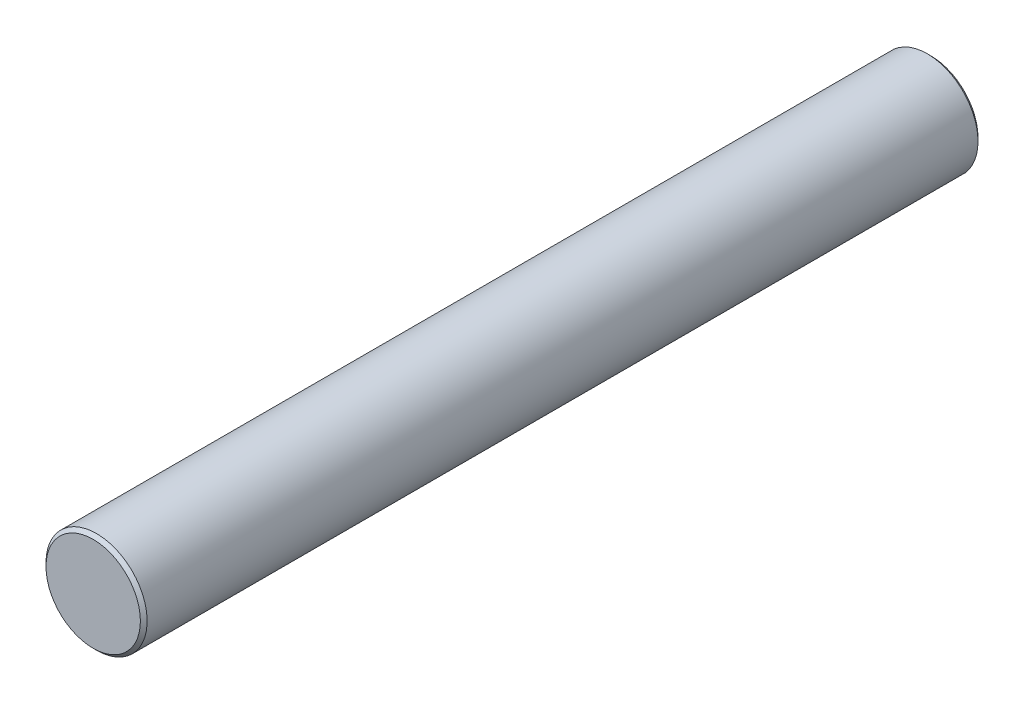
ISO-10303-21;
HEADER;
FILE_DESCRIPTION(('STEP AP214'),'2;1');
FILE_NAME('part.step','',(''),(''),'','','');
FILE_SCHEMA(('AUTOMOTIVE_DESIGN { 1 0 10303 214 1 1 1 1 }'));
ENDSEC;
DATA;
#1=APPLICATION_CONTEXT('core data for automotive mechanical design processes');
#2=APPLICATION_PROTOCOL_DEFINITION('international standard','automotive_design',2000,#1);
#3=PRODUCT_CONTEXT('',#1,'mechanical');
#4=PRODUCT('Part','Part','',(#3));
#5=PRODUCT_RELATED_PRODUCT_CATEGORY('part','',(#4));
#6=PRODUCT_DEFINITION_FORMATION('','',#4);
#7=PRODUCT_DEFINITION_CONTEXT('part definition',#1,'design');
#8=PRODUCT_DEFINITION('design','',#6,#7);
#9=PRODUCT_DEFINITION_SHAPE('','',#8);
#10=(LENGTH_UNIT() NAMED_UNIT(*) SI_UNIT(.MILLI.,.METRE.));
#11=(NAMED_UNIT(*) PLANE_ANGLE_UNIT() SI_UNIT($,.RADIAN.));
#12=(NAMED_UNIT(*) SI_UNIT($,.STERADIAN.) SOLID_ANGLE_UNIT());
#13=UNCERTAINTY_MEASURE_WITH_UNIT(LENGTH_MEASURE(1.E-05),#10,'distance_accuracy_value','');
#14=(GEOMETRIC_REPRESENTATION_CONTEXT(3) GLOBAL_UNCERTAINTY_ASSIGNED_CONTEXT((#13)) GLOBAL_UNIT_ASSIGNED_CONTEXT((#10,
#11,#12)) REPRESENTATION_CONTEXT('',''));
#15=CARTESIAN_POINT('',(0.,0.,0.));
#16=DIRECTION('',(0.,0.,1.));
#17=DIRECTION('',(1.,0.,0.));
#18=AXIS2_PLACEMENT_3D('',#15,#16,#17);
#19=CARTESIAN_POINT('',(0.,0.,497.));
#20=DIRECTION('',(0.,0.,-1.));
#21=DIRECTION('',(-1.,0.,0.));
#22=AXIS2_PLACEMENT_3D('',#19,#20,#21);
#23=CYLINDRICAL_SURFACE('',#22,30.);
#24=CARTESIAN_POINT('',(0.,0.,495.));
#25=DIRECTION('',(0.,0.,1.));
#26=DIRECTION('',(1.,0.,0.));
#27=AXIS2_PLACEMENT_3D('',#24,#25,#26);
#28=CIRCLE('',#27,30.);
#29=CARTESIAN_POINT('',(-30.,0.,495.));
#30=VERTEX_POINT('',#29);
#31=EDGE_CURVE('E46',#30,#30,#28,.F.);
#32=CARTESIAN_POINT('',(0.,0.,2.0000000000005));
#33=DIRECTION('',(0.,0.,1.));
#34=DIRECTION('',(1.,0.,0.));
#35=AXIS2_PLACEMENT_3D('',#32,#33,#34);
#36=CIRCLE('',#35,30.);
#37=CARTESIAN_POINT('',(-30.,0.,2.0000000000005));
#38=VERTEX_POINT('',#37);
#39=EDGE_CURVE('E63',#38,#38,#36,.T.);
#40=CARTESIAN_POINT('',(-30.,0.,495.));
#41=CARTESIAN_POINT('',(-30.,0.,489.864583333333));
#42=CARTESIAN_POINT('',(-30.,0.,484.729166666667));
#43=CARTESIAN_POINT('',(-30.,0.,474.458333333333));
#44=CARTESIAN_POINT('',(-30.,0.,469.322916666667));
#45=CARTESIAN_POINT('',(-30.,0.,459.052083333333));
#46=CARTESIAN_POINT('',(-30.,0.,453.916666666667));
#47=CARTESIAN_POINT('',(-30.,0.,443.645833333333));
#48=CARTESIAN_POINT('',(-30.,0.,438.510416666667));
#49=CARTESIAN_POINT('',(-30.,0.,428.239583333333));
#50=CARTESIAN_POINT('',(-30.,0.,423.104166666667));
#51=CARTESIAN_POINT('',(-30.,0.,412.833333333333));
#52=CARTESIAN_POINT('',(-30.,0.,407.697916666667));
#53=CARTESIAN_POINT('',(-30.,0.,397.427083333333));
#54=CARTESIAN_POINT('',(-30.,0.,392.291666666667));
#55=CARTESIAN_POINT('',(-30.,0.,382.020833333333));
#56=CARTESIAN_POINT('',(-30.,0.,376.885416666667));
#57=CARTESIAN_POINT('',(-30.,0.,366.614583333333));
#58=CARTESIAN_POINT('',(-30.,0.,361.479166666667));
#59=CARTESIAN_POINT('',(-30.,0.,351.208333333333));
#60=CARTESIAN_POINT('',(-30.,0.,346.072916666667));
#61=CARTESIAN_POINT('',(-30.,0.,335.802083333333));
#62=CARTESIAN_POINT('',(-30.,0.,330.666666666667));
#63=CARTESIAN_POINT('',(-30.,0.,320.395833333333));
#64=CARTESIAN_POINT('',(-30.,0.,315.260416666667));
#65=CARTESIAN_POINT('',(-30.,0.,304.989583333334));
#66=CARTESIAN_POINT('',(-30.,0.,299.854166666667));
#67=CARTESIAN_POINT('',(-30.,0.,289.583333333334));
#68=CARTESIAN_POINT('',(-30.,0.,284.447916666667));
#69=CARTESIAN_POINT('',(-30.,0.,274.177083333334));
#70=CARTESIAN_POINT('',(-30.,0.,269.041666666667));
#71=CARTESIAN_POINT('',(-30.,0.,258.770833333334));
#72=CARTESIAN_POINT('',(-30.,0.,253.635416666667));
#73=CARTESIAN_POINT('',(-30.,0.,243.364583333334));
#74=CARTESIAN_POINT('',(-30.,0.,238.229166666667));
#75=CARTESIAN_POINT('',(-30.,0.,227.958333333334));
#76=CARTESIAN_POINT('',(-30.,0.,222.822916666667));
#77=CARTESIAN_POINT('',(-30.,0.,212.552083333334));
#78=CARTESIAN_POINT('',(-30.,0.,207.416666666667));
#79=CARTESIAN_POINT('',(-30.,0.,197.145833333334));
#80=CARTESIAN_POINT('',(-30.,0.,192.010416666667));
#81=CARTESIAN_POINT('',(-30.,0.,181.739583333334));
#82=CARTESIAN_POINT('',(-30.,0.,176.604166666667));
#83=CARTESIAN_POINT('',(-30.,0.,166.333333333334));
#84=CARTESIAN_POINT('',(-30.,0.,161.197916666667));
#85=CARTESIAN_POINT('',(-30.,0.,150.927083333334));
#86=CARTESIAN_POINT('',(-30.,0.,145.791666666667));
#87=CARTESIAN_POINT('',(-30.,0.,135.520833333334));
#88=CARTESIAN_POINT('',(-30.,0.,130.385416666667));
#89=CARTESIAN_POINT('',(-30.,0.,120.114583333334));
#90=CARTESIAN_POINT('',(-30.,0.,114.979166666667));
#91=CARTESIAN_POINT('',(-30.,0.,104.708333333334));
#92=CARTESIAN_POINT('',(-30.,0.,99.5729166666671));
#93=CARTESIAN_POINT('',(-30.,0.,89.3020833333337));
#94=CARTESIAN_POINT('',(-30.,0.,84.1666666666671));
#95=CARTESIAN_POINT('',(-30.,0.,73.8958333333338));
#96=CARTESIAN_POINT('',(-30.,0.,68.7604166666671));
#97=CARTESIAN_POINT('',(-30.,0.,58.4895833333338));
#98=CARTESIAN_POINT('',(-30.,0.,53.3541666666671));
#99=CARTESIAN_POINT('',(-30.,0.,43.0833333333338));
#100=CARTESIAN_POINT('',(-30.,0.,37.9479166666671));
#101=CARTESIAN_POINT('',(-30.,0.,27.6770833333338));
#102=CARTESIAN_POINT('',(-30.,0.,22.5416666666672));
#103=CARTESIAN_POINT('',(-30.,0.,12.2708333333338));
#104=CARTESIAN_POINT('',(-30.,0.,7.13541666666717));
#105=CARTESIAN_POINT('',(-30.,0.,2.0000000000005));
#106=B_SPLINE_CURVE_WITH_KNOTS('',3,(#40,#41,#42,#43,#44,#45,#46,#47,#48,#49,#50,#51,#52,#53,
#54,#55,#56,#57,#58,#59,#60,#61,#62,#63,#64,#65,#66,#67,#68,#69,#70,#71,#72,#73,#74,#75,#76,#77,
#78,#79,#80,#81,#82,#83,#84,#85,#86,#87,#88,#89,#90,#91,#92,#93,#94,#95,#96,#97,#98,#99,#100,
#101,#102,#103,#104,#105),.UNSPECIFIED.,.F.,.F.,(4,2,2,2,2,2,2,2,2,2,2,2,2,2,2,2,2,2,2,2,2,2,2,
2,2,2,2,2,2,2,2,2,4),(0.,15.40625,30.8125,46.2187499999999,61.6249999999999,77.0312499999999,
92.4374999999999,107.84375,123.25,138.65625,154.0625,169.46875,184.875,200.28125,215.6875,
231.09375,246.5,261.90625,277.3125,292.71875,308.125,323.53125,338.9375,354.34375,369.75,
385.15625,400.5625,415.968749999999,431.374999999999,446.781249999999,462.187499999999,
477.593749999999,492.999999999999),.UNSPECIFIED.);
#107=EDGE_CURVE('BSEAM39',#30,#38,#106,.T.);
#108=ORIENTED_EDGE('',*,*,#31,.T.);
#109=ORIENTED_EDGE('',*,*,#39,.T.);
#110=ORIENTED_EDGE('',*,*,#107,.T.);
#111=ORIENTED_EDGE('',*,*,#107,.F.);
#112=EDGE_LOOP('',(#108,#110,#109,#111));
#113=FACE_BOUND('',#112,.T.);
#114=ADVANCED_FACE('F39',(#113),#23,.T.);
#115=CARTESIAN_POINT('',(0.,0.,497.));
#116=DIRECTION('',(0.,0.,1.));
#117=DIRECTION('',(1.,0.,0.));
#118=AXIS2_PLACEMENT_3D('',#115,#116,#117);
#119=PLANE('',#118);
#120=CARTESIAN_POINT('',(0.,0.,497.));
#121=DIRECTION('',(0.,0.,1.));
#122=DIRECTION('',(1.,0.,0.));
#123=AXIS2_PLACEMENT_3D('',#120,#121,#122);
#124=CIRCLE('',#123,28.0000000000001);
#125=CARTESIAN_POINT('',(28.0000000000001,0.,497.));
#126=VERTEX_POINT('',#125);
#127=EDGE_CURVE('E59',#126,#126,#124,.T.);
#128=ORIENTED_EDGE('',*,*,#127,.T.);
#129=EDGE_LOOP('',(#128));
#130=FACE_BOUND('',#129,.T.);
#131=ADVANCED_FACE('F79',(#130),#119,.T.);
#132=CARTESIAN_POINT('',(0.,0.,0.));
#133=DIRECTION('',(0.,0.,1.));
#134=DIRECTION('',(1.,0.,0.));
#135=AXIS2_PLACEMENT_3D('',#132,#133,#134);
#136=PLANE('',#135);
#137=CARTESIAN_POINT('',(0.,0.,0.));
#138=DIRECTION('',(0.,0.,1.));
#139=DIRECTION('',(1.,0.,0.));
#140=AXIS2_PLACEMENT_3D('',#137,#138,#139);
#141=CIRCLE('',#140,27.9999999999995);
#142=CARTESIAN_POINT('',(27.9999999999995,0.,0.));
#143=VERTEX_POINT('',#142);
#144=EDGE_CURVE('E11',#143,#143,#141,.F.);
#145=ORIENTED_EDGE('',*,*,#144,.T.);
#146=EDGE_LOOP('',(#145));
#147=FACE_BOUND('',#146,.T.);
#148=CARTESIAN_POINT('',(0.,0.,0.));
#149=DIRECTION('',(0.,0.,-1.));
#150=DIRECTION('',(-1.,0.,0.));
#151=AXIS2_PLACEMENT_3D('',#148,#149,#150);
#152=CIRCLE('',#151,6.99999999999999);
#153=CARTESIAN_POINT('',(-6.99999999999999,0.,0.));
#154=VERTEX_POINT('',#153);
#155=EDGE_CURVE('E60',#154,#154,#152,.T.);
#156=ORIENTED_EDGE('',*,*,#155,.F.);
#157=EDGE_LOOP('',(#156));
#158=FACE_BOUND('',#157,.T.);
#159=ADVANCED_FACE('F53',(#147,#158),#136,.F.);
#160=CARTESIAN_POINT('',(0.,0.,38.));
#161=DIRECTION('',(0.,0.,-1.));
#162=DIRECTION('',(-1.,0.,0.));
#163=AXIS2_PLACEMENT_3D('',#160,#161,#162);
#164=CONICAL_SURFACE('',#163,6.99999999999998,1.02974425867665);
#165=CARTESIAN_POINT('',(0.,0.,42.2060243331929));
#166=VERTEX_POINT('',#165);
#167=VERTEX_LOOP('',#166);
#168=FACE_BOUND('',#167,.T.);
#169=CARTESIAN_POINT('',(0.,0.,38.));
#170=DIRECTION('',(0.,0.,-1.));
#171=DIRECTION('',(-1.,0.,0.));
#172=AXIS2_PLACEMENT_3D('',#169,#170,#171);
#173=CIRCLE('',#172,6.99999999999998);
#174=CARTESIAN_POINT('',(-6.99999999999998,0.,38.));
#175=VERTEX_POINT('',#174);
#176=EDGE_CURVE('E57',#175,#175,#173,.T.);
#177=ORIENTED_EDGE('',*,*,#176,.T.);
#178=EDGE_LOOP('',(#177));
#179=FACE_BOUND('',#178,.T.);
#180=ADVANCED_FACE('F49',(#168,#179),#164,.F.);
#181=CARTESIAN_POINT('',(0.,0.,0.));
#182=DIRECTION('',(0.,0.,-1.));
#183=DIRECTION('',(-1.,0.,0.));
#184=AXIS2_PLACEMENT_3D('',#181,#182,#183);
#185=CYLINDRICAL_SURFACE('',#184,6.99999999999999);
#186=ORIENTED_EDGE('',*,*,#176,.F.);
#187=EDGE_LOOP('',(#186));
#188=FACE_BOUND('',#187,.T.);
#189=ORIENTED_EDGE('',*,*,#155,.T.);
#190=EDGE_LOOP('',(#189));
#191=FACE_BOUND('',#190,.T.);
#192=ADVANCED_FACE('F52',(#188,#191),#185,.F.);
#193=CARTESIAN_POINT('',(0.,0.,497.));
#194=DIRECTION('',(0.,0.,-1.));
#195=DIRECTION('',(-1.,0.,0.));
#196=AXIS2_PLACEMENT_3D('',#193,#194,#195);
#197=CONICAL_SURFACE('',#196,28.0000000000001,0.785398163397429);
#198=ORIENTED_EDGE('',*,*,#31,.F.);
#199=EDGE_LOOP('',(#198));
#200=FACE_BOUND('',#199,.T.);
#201=ORIENTED_EDGE('',*,*,#127,.F.);
#202=EDGE_LOOP('',(#201));
#203=FACE_BOUND('',#202,.T.);
#204=ADVANCED_FACE('F74',(#200,#203),#197,.T.);
#205=CARTESIAN_POINT('',(0.,0.,2.0000000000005));
#206=DIRECTION('',(0.,0.,1.));
#207=DIRECTION('',(1.,0.,0.));
#208=AXIS2_PLACEMENT_3D('',#205,#206,#207);
#209=CONICAL_SURFACE('',#208,30.,0.785398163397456);
#210=ORIENTED_EDGE('',*,*,#144,.F.);
#211=EDGE_LOOP('',(#210));
#212=FACE_BOUND('',#211,.T.);
#213=ORIENTED_EDGE('',*,*,#39,.F.);
#214=EDGE_LOOP('',(#213));
#215=FACE_BOUND('',#214,.T.);
#216=ADVANCED_FACE('F41',(#212,#215),#209,.T.);
#217=CLOSED_SHELL('',(#114,#131,#159,#180,#192,#204,#216));
#218=MANIFOLD_SOLID_BREP('B2',#217);
#219=ADVANCED_BREP_SHAPE_REPRESENTATION('',(#18,#218),#14);
#220=SHAPE_DEFINITION_REPRESENTATION(#9,#219);
ENDSEC;
END-ISO-10303-21;
